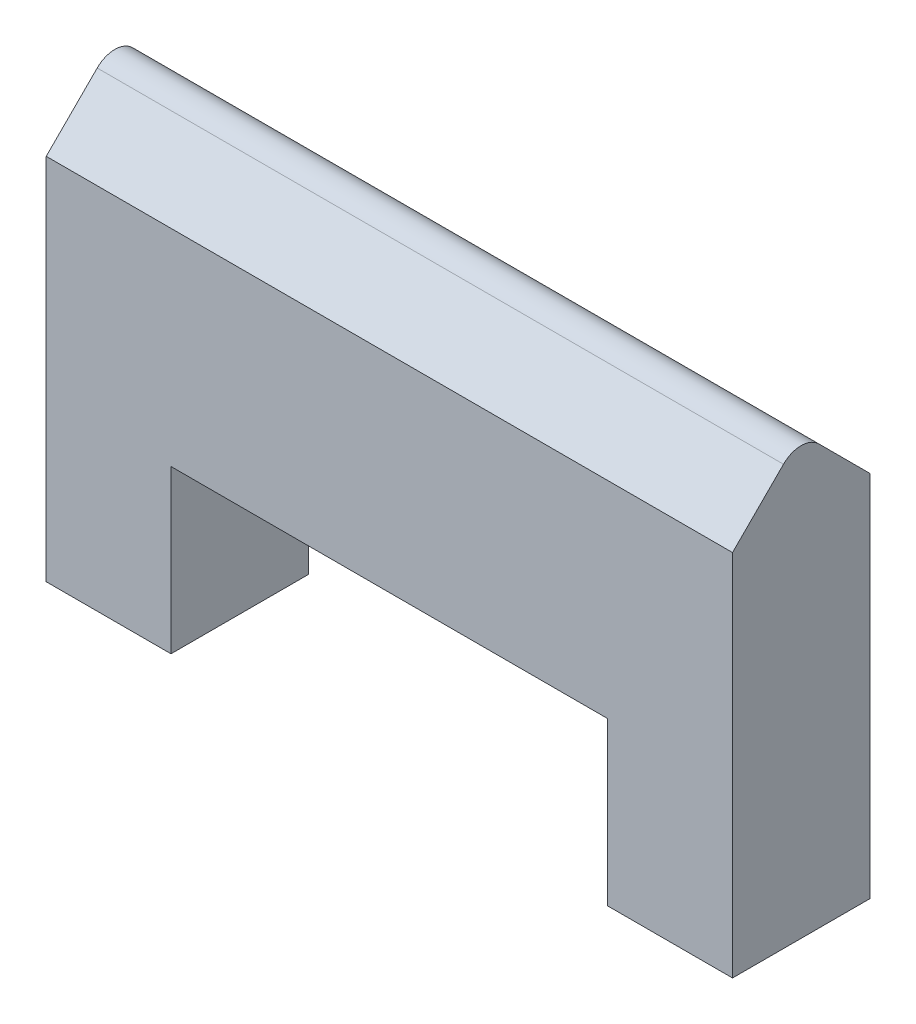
from build123d import *

# Parameters (mm, degrees)
EXTRUSION1_DEPTH                  = 5.5
DIAM_TRE_DU_PER_AGE_5_0_5_1_D     = 5
DIAM_TRE_DU_PER_AGE_5_0_5_1_DEPTH = 10
DIAM_TRE_DU_PER_AGE_5_0_5_1_TIP   = 1.502151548
ENL_V_MAT_EXTRU_1_DEPTH           = 66.423619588


with BuildPart() as part:
    # Esquisse1 → Extrusion1 (new, symmetric)
    with BuildSketch(Plane.XY):
        Polygon((45, 0), (55, 0), (55, 35), (0, 35), (0, 0), (10, 0), (10, 13), (45, 13), align=None)
    extrude(amount=EXTRUSION1_DEPTH, both=True)

    # Diam_tre du per_age _5.0 _5_1
    with Locations(Plane.XZ.offset(-13)):
        with Locations((27.5, 0)):
            Hole(DIAM_TRE_DU_PER_AGE_5_0_5_1_D / 2, depth=DIAM_TRE_DU_PER_AGE_5_0_5_1_DEPTH)
            with Locations((0, 0, -(DIAM_TRE_DU_PER_AGE_5_0_5_1_DEPTH + DIAM_TRE_DU_PER_AGE_5_0_5_1_TIP / 2))):  # 118° drill point
                Cone(0, DIAM_TRE_DU_PER_AGE_5_0_5_1_D / 2, DIAM_TRE_DU_PER_AGE_5_0_5_1_TIP, mode=Mode.SUBTRACT)

    # Esquisse4 → Enl_v. mat.-Extru.1 (cut, through all)
    with BuildSketch(Plane(origin=(55, 0, 0), x_dir=(0, 0, -1), z_dir=(1, 0, 0))):
        with BuildLine():
            Line((-1.414213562, 33.614213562), (-5.5, 29.528427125))
            Line((-5.5, 29.528427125), (-5.5, 36.322222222))
            Line((-5.5, 36.322222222), (5.5, 36.322222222))
            Line((5.5, 36.322222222), (5.5, 29.528427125))
            Line((5.5, 29.528427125), (1.414213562, 33.614213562))
            ThreePointArc((1.414213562, 33.614213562), (0, 34.2), (-1.414213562, 33.614213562))
        make_face()
    extrude(amount=-ENL_V_MAT_EXTRU_1_DEPTH, mode=Mode.SUBTRACT)


solid = part.part
